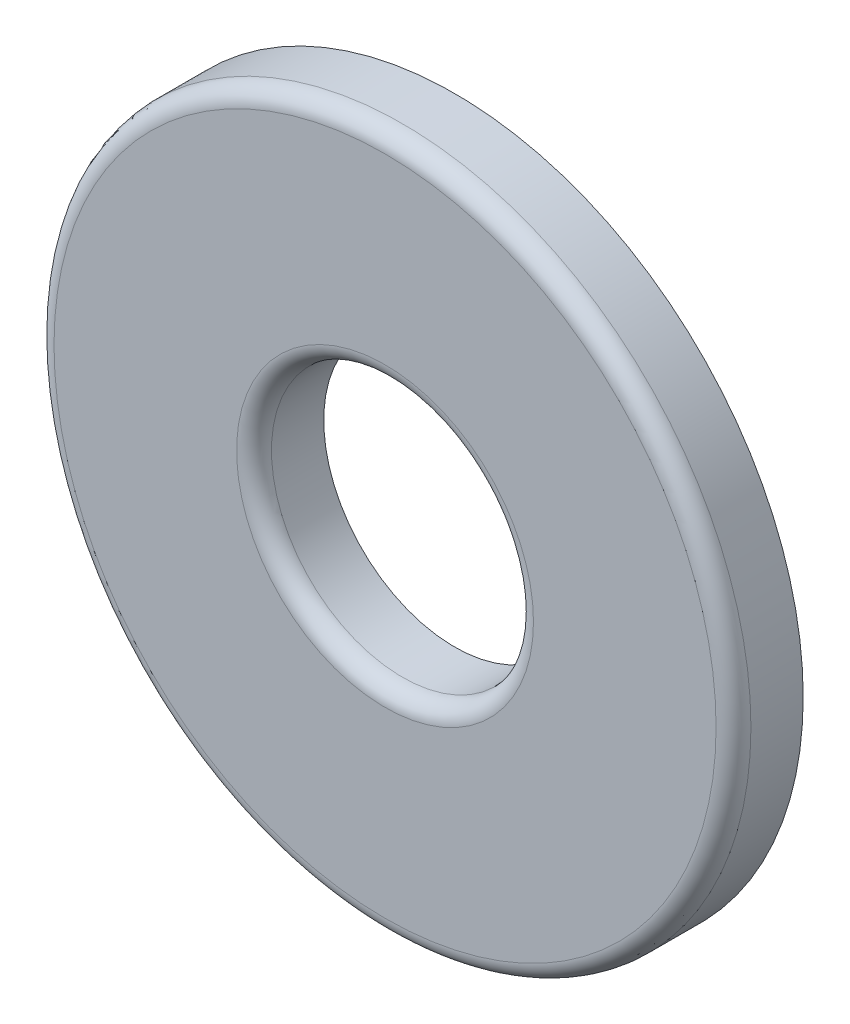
from build123d import *

# Parameters (mm, degrees)
BOSS_EXTRUDE1_DEPTH      = 0.3175
BOSS_EXTRUDE1_DEPTH_BACK = 0.3175
SKETCH3_R                = 3.175
SKETCH3_R_2              = 1.1938
FILLET1_R                = 0.15875


with BuildPart() as part:
    # Sketch3 → Boss-Extrude1 (new, two sides: drawn at the far end of the back side and taken through both)
    with BuildSketch(Plane.XY.offset(-BOSS_EXTRUDE1_DEPTH_BACK)):
        Circle(SKETCH3_R)
        Circle(SKETCH3_R_2, mode=Mode.SUBTRACT)
    extrude(amount=BOSS_EXTRUDE1_DEPTH + BOSS_EXTRUDE1_DEPTH_BACK)

    # Fillet1
    fillet1_edges = [part.edges().sort_by_distance(p)[0] for p in [
        (-3.175, 0, 0.3175),
        (-1.1938, 0, 0.3175),
    ]]
    fillet(fillet1_edges, radius=FILLET1_R)


solid = part.part
